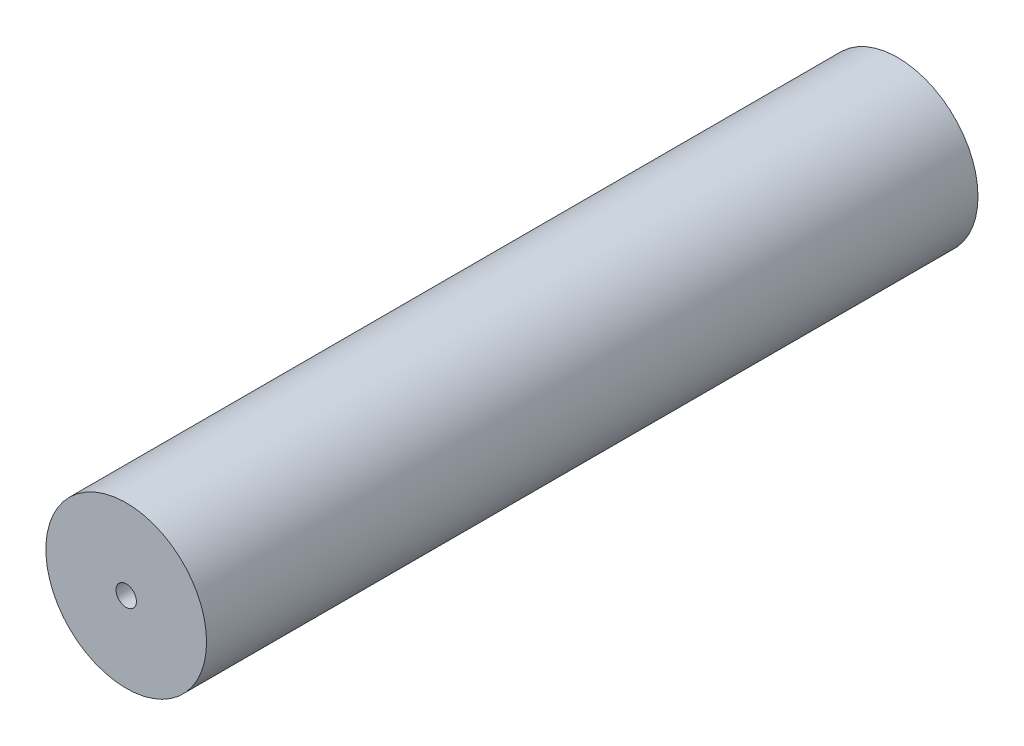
from build123d import *

# Parameters (mm, degrees)
SKETCH1_R           = 12.5
SKETCH1_R_2         = 1.5875
BOSS_EXTRUDE1_DEPTH = 120


with BuildPart() as part:
    # Sketch1 → Boss-Extrude1 (new body)
    with BuildSketch(Plane.XY):
        with Locations((15.575, 20.9125)):
            Circle(SKETCH1_R)
        with Locations((15.575, 20.9125)):
            Circle(SKETCH1_R_2, mode=Mode.SUBTRACT)
    extrude(amount=-BOSS_EXTRUDE1_DEPTH)


solid = part.part
